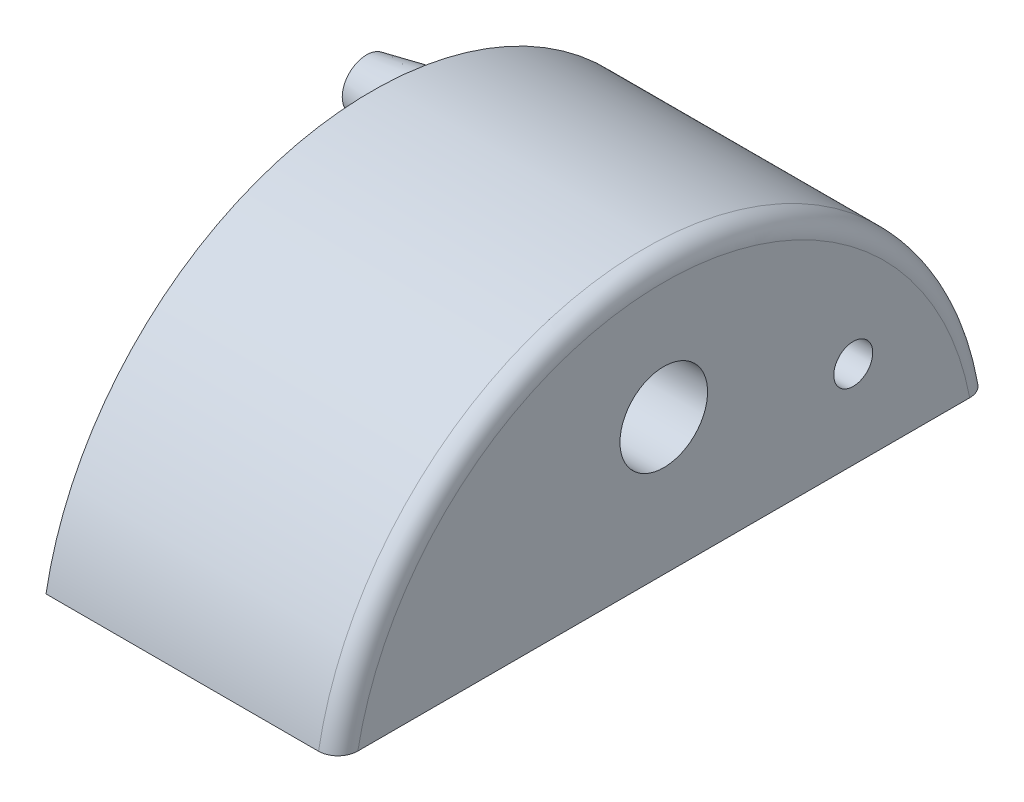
ISO-10303-21;
HEADER;
FILE_DESCRIPTION(('STEP AP214'),'2;1');
FILE_NAME('part.step','',(''),(''),'','','');
FILE_SCHEMA(('AUTOMOTIVE_DESIGN { 1 0 10303 214 1 1 1 1 }'));
ENDSEC;
DATA;
#1=APPLICATION_CONTEXT('core data for automotive mechanical design processes');
#2=APPLICATION_PROTOCOL_DEFINITION('international standard','automotive_design',2000,#1);
#3=PRODUCT_CONTEXT('',#1,'mechanical');
#4=PRODUCT('Part','Part','',(#3));
#5=PRODUCT_RELATED_PRODUCT_CATEGORY('part','',(#4));
#6=PRODUCT_DEFINITION_FORMATION('','',#4);
#7=PRODUCT_DEFINITION_CONTEXT('part definition',#1,'design');
#8=PRODUCT_DEFINITION('design','',#6,#7);
#9=PRODUCT_DEFINITION_SHAPE('','',#8);
#10=(LENGTH_UNIT() NAMED_UNIT(*) SI_UNIT(.MILLI.,.METRE.));
#11=(NAMED_UNIT(*) PLANE_ANGLE_UNIT() SI_UNIT($,.RADIAN.));
#12=(NAMED_UNIT(*) SI_UNIT($,.STERADIAN.) SOLID_ANGLE_UNIT());
#13=UNCERTAINTY_MEASURE_WITH_UNIT(LENGTH_MEASURE(1.E-05),#10,'distance_accuracy_value','');
#14=(GEOMETRIC_REPRESENTATION_CONTEXT(3) GLOBAL_UNCERTAINTY_ASSIGNED_CONTEXT((#13)) GLOBAL_UNIT_ASSIGNED_CONTEXT((#10,
#11,#12)) REPRESENTATION_CONTEXT('',''));
#15=CARTESIAN_POINT('',(0.,0.,0.));
#16=DIRECTION('',(0.,0.,1.));
#17=DIRECTION('',(1.,0.,0.));
#18=AXIS2_PLACEMENT_3D('',#15,#16,#17);
#19=CARTESIAN_POINT('',(15.,0.,0.));
#20=DIRECTION('',(-1.,0.,0.));
#21=DIRECTION('',(0.,0.,1.));
#22=AXIS2_PLACEMENT_3D('',#19,#20,#21);
#23=CYLINDRICAL_SURFACE('',#22,17.);
#24=DIRECTION('',(-1.,0.,0.));
#25=VECTOR('',#24,1.);
#26=CARTESIAN_POINT('',(15.,3.,16.7332005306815));
#27=LINE('',#26,#25);
#28=CARTESIAN_POINT('',(14.,3.,16.7332005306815));
#29=VERTEX_POINT('',#28);
#30=CARTESIAN_POINT('',(0.,3.,16.7332005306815));
#31=VERTEX_POINT('',#30);
#32=EDGE_CURVE('E73',#29,#31,#27,.T.);
#33=ORIENTED_EDGE('',*,*,#32,.F.);
#34=CARTESIAN_POINT('',(14.,0.,0.));
#35=DIRECTION('',(-1.,0.,0.));
#36=DIRECTION('',(0.,0.,1.));
#37=AXIS2_PLACEMENT_3D('',#34,#35,#36);
#38=CIRCLE('',#37,17.);
#39=CARTESIAN_POINT('',(14.,3.,-16.7332005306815));
#40=VERTEX_POINT('',#39);
#41=EDGE_CURVE('E62',#29,#40,#38,.T.);
#42=ORIENTED_EDGE('',*,*,#41,.T.);
#43=DIRECTION('',(-1.,0.,0.));
#44=VECTOR('',#43,1.);
#45=CARTESIAN_POINT('',(15.,3.,-16.7332005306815));
#46=LINE('',#45,#44);
#47=CARTESIAN_POINT('',(0.,3.,-16.7332005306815));
#48=VERTEX_POINT('',#47);
#49=EDGE_CURVE('E81',#40,#48,#46,.T.);
#50=ORIENTED_EDGE('',*,*,#49,.T.);
#51=CARTESIAN_POINT('',(0.,0.,0.));
#52=DIRECTION('',(1.,0.,0.));
#53=DIRECTION('',(0.,0.,1.));
#54=AXIS2_PLACEMENT_3D('',#51,#52,#53);
#55=CIRCLE('',#54,17.);
#56=EDGE_CURVE('E85',#48,#31,#55,.T.);
#57=ORIENTED_EDGE('',*,*,#56,.T.);
#58=EDGE_LOOP('',(#33,#42,#50,#57));
#59=FACE_BOUND('',#58,.T.);
#60=ADVANCED_FACE('F39',(#59),#23,.T.);
#61=CARTESIAN_POINT('',(15.,3.,16.7332005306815));
#62=DIRECTION('',(0.,1.,0.));
#63=DIRECTION('',(0.,0.,1.));
#64=AXIS2_PLACEMENT_3D('',#61,#62,#63);
#65=PLANE('',#64);
#66=DIRECTION('',(0.,0.,-1.));
#67=VECTOR('',#66,1.);
#68=CARTESIAN_POINT('',(15.,3.,16.7332005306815));
#69=LINE('',#68,#67);
#70=CARTESIAN_POINT('',(15.,3.,15.7162336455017));
#71=VERTEX_POINT('',#70);
#72=CARTESIAN_POINT('',(15.,3.,-15.7162336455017));
#73=VERTEX_POINT('',#72);
#74=EDGE_CURVE('E87',#71,#73,#69,.T.);
#75=ORIENTED_EDGE('',*,*,#74,.F.);
#76=CARTESIAN_POINT('',(15.,3.,15.7162336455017));
#77=CARTESIAN_POINT('',(15.0000448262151,3.,15.7741857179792));
#78=CARTESIAN_POINT('',(14.9951419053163,3.,15.832131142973));
#79=CARTESIAN_POINT('',(14.9757506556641,3.,15.9463826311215));
#80=CARTESIAN_POINT('',(14.9612645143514,3.,16.0026890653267));
#81=CARTESIAN_POINT('',(14.9230032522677,3.,16.1121027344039));
#82=CARTESIAN_POINT('',(14.899221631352,3.,16.1652077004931));
#83=CARTESIAN_POINT('',(14.8430105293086,3.,16.2666054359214));
#84=CARTESIAN_POINT('',(14.8105840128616,3.,16.3148998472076));
#85=CARTESIAN_POINT('',(14.7382831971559,3.,16.4048324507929));
#86=CARTESIAN_POINT('',(14.6984788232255,3.,16.4465268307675));
#87=CARTESIAN_POINT('',(14.6123218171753,3.,16.5225170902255));
#88=CARTESIAN_POINT('',(14.5659681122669,3.,16.5568117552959));
#89=CARTESIAN_POINT('',(14.4688365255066,3.,16.6164335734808));
#90=CARTESIAN_POINT('',(14.4181408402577,3.,16.6418948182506));
#91=CARTESIAN_POINT('',(14.3131672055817,3.,16.6837904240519));
#92=CARTESIAN_POINT('',(14.2588922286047,3.,16.7002321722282));
#93=CARTESIAN_POINT('',(14.1701703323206,3.,16.7189869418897));
#94=CARTESIAN_POINT('',(14.1363318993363,3.,16.7243140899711));
#95=CARTESIAN_POINT('',(14.0683342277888,3.,16.7314198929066));
#96=CARTESIAN_POINT('',(14.0341755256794,3.,16.733203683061));
#97=CARTESIAN_POINT('',(14.,3.,16.7332005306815));
#98=B_SPLINE_CURVE_WITH_KNOTS('',3,(#76,#77,#78,#79,#80,#81,#82,#83,#84,#85,#86,#87,#88,#89,#90,
#91,#92,#93,#94,#95,#96,#97),.UNSPECIFIED.,.F.,.F.,(4,2,2,2,2,2,2,2,2,2,4),(0.,
0.173640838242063,0.347242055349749,0.520964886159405,0.694628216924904,0.866722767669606,
1.0388455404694,1.20822766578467,1.37747085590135,1.48006684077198,1.58251402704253),.UNSPECIFIED.);
#99=EDGE_CURVE('E55',#71,#29,#98,.T.);
#100=ORIENTED_EDGE('',*,*,#99,.T.);
#101=ORIENTED_EDGE('',*,*,#32,.T.);
#102=DIRECTION('',(0.,0.,-1.));
#103=VECTOR('',#102,1.);
#104=CARTESIAN_POINT('',(0.,3.,16.7332005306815));
#105=LINE('',#104,#103);
#106=EDGE_CURVE('E76',#31,#48,#105,.T.);
#107=ORIENTED_EDGE('',*,*,#106,.T.);
#108=ORIENTED_EDGE('',*,*,#49,.F.);
#109=CARTESIAN_POINT('',(14.,3.,-16.7332005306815));
#110=CARTESIAN_POINT('',(14.0278086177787,3.,-16.7332005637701));
#111=CARTESIAN_POINT('',(14.0556038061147,3.,-16.7320212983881));
#112=CARTESIAN_POINT('',(14.1109929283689,3.,-16.727318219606));
#113=CARTESIAN_POINT('',(14.1385868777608,3.,-16.7237945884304));
#114=CARTESIAN_POINT('',(14.2206983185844,3.,-16.7097473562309));
#115=CARTESIAN_POINT('',(14.2746619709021,3.,-16.6957472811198));
#116=CARTESIAN_POINT('',(14.3794651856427,3.,-16.6588988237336));
#117=CARTESIAN_POINT('',(14.4303036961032,3.,-16.6360474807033));
#118=CARTESIAN_POINT('',(14.527459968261,3.,-16.5821892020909));
#119=CARTESIAN_POINT('',(14.5737779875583,3.,-16.5511827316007));
#120=CARTESIAN_POINT('',(14.6609239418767,3.,-16.4817033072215));
#121=CARTESIAN_POINT('',(14.7017136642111,3.,-16.4431824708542));
#122=CARTESIAN_POINT('',(14.7763699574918,3.,-16.3599224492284));
#123=CARTESIAN_POINT('',(14.8102350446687,3.,-16.3151819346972));
#124=CARTESIAN_POINT('',(14.8706209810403,3.,-16.2200438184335));
#125=CARTESIAN_POINT('',(14.8970230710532,3.,-16.1695709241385));
#126=CARTESIAN_POINT('',(14.9411181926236,3.,-16.0649621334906));
#127=CARTESIAN_POINT('',(14.9588141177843,3.,-16.0108274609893));
#128=CARTESIAN_POINT('',(14.9812689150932,3.,-15.9164280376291));
#129=CARTESIAN_POINT('',(14.98829001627,3.,-15.8766853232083));
#130=CARTESIAN_POINT('',(14.9976553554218,3.,-15.7967107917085));
#131=CARTESIAN_POINT('',(15.0000063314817,3.,-15.7564797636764));
#132=CARTESIAN_POINT('',(15.,3.,-15.7162336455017));
#133=B_SPLINE_CURVE_WITH_KNOTS('',3,(#109,#110,#111,#112,#113,#114,#115,#116,#117,#118,#119,
#120,#121,#122,#123,#124,#125,#126,#127,#128,#129,#130,#131,#132),.UNSPECIFIED.,.F.,.F.,(4,2,2,
2,2,2,2,2,2,2,2,4),(0.,0.0833742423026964,0.166742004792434,0.333132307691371,0.499578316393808,
0.666014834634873,0.833548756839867,1.00111853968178,1.17122142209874,1.3412677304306,
1.46208234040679,1.58272251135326),.UNSPECIFIED.);
#134=EDGE_CURVE('E104',#40,#73,#133,.T.);
#135=ORIENTED_EDGE('',*,*,#134,.T.);
#136=EDGE_LOOP('',(#75,#100,#101,#107,#108,#135));
#137=FACE_BOUND('',#136,.T.);
#138=ADVANCED_FACE('F75',(#137),#65,.F.);
#139=CARTESIAN_POINT('',(15.,0.,0.));
#140=DIRECTION('',(-1.,0.,0.));
#141=DIRECTION('',(0.,0.,1.));
#142=AXIS2_PLACEMENT_3D('',#139,#140,#141);
#143=PLANE('',#142);
#144=CARTESIAN_POINT('',(15.,7.5,-9.73320053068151));
#145=DIRECTION('',(-1.,0.,0.));
#146=DIRECTION('',(0.,0.,1.));
#147=AXIS2_PLACEMENT_3D('',#144,#145,#146);
#148=CIRCLE('',#147,1.);
#149=CARTESIAN_POINT('',(15.,7.5,-8.73320053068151));
#150=VERTEX_POINT('',#149);
#151=EDGE_CURVE('E209',#150,#150,#148,.T.);
#152=ORIENTED_EDGE('',*,*,#151,.T.);
#153=EDGE_LOOP('',(#152));
#154=FACE_BOUND('',#153,.T.);
#155=CARTESIAN_POINT('',(15.,10.,0.));
#156=DIRECTION('',(-1.,0.,0.));
#157=DIRECTION('',(0.,0.,1.));
#158=AXIS2_PLACEMENT_3D('',#155,#156,#157);
#159=CIRCLE('',#158,2.25);
#160=CARTESIAN_POINT('',(15.,10.,2.25));
#161=VERTEX_POINT('',#160);
#162=EDGE_CURVE('E90',#161,#161,#159,.T.);
#163=ORIENTED_EDGE('',*,*,#162,.T.);
#164=EDGE_LOOP('',(#163));
#165=FACE_BOUND('',#164,.T.);
#166=ORIENTED_EDGE('',*,*,#74,.T.);
#167=CARTESIAN_POINT('',(15.,0.,0.));
#168=DIRECTION('',(-1.,0.,0.));
#169=DIRECTION('',(0.,0.,1.));
#170=AXIS2_PLACEMENT_3D('',#167,#168,#169);
#171=CIRCLE('',#170,16.);
#172=EDGE_CURVE('E80',#73,#71,#171,.F.);
#173=ORIENTED_EDGE('',*,*,#172,.T.);
#174=EDGE_LOOP('',(#166,#173));
#175=FACE_BOUND('',#174,.T.);
#176=ADVANCED_FACE('F123',(#154,#165,#175),#143,.F.);
#177=CARTESIAN_POINT('',(0.,0.,0.));
#178=DIRECTION('',(-1.,0.,0.));
#179=DIRECTION('',(0.,0.,1.));
#180=AXIS2_PLACEMENT_3D('',#177,#178,#179);
#181=PLANE('',#180);
#182=CARTESIAN_POINT('',(0.,7.5,-9.73320053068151));
#183=DIRECTION('',(-1.,0.,0.));
#184=DIRECTION('',(0.,0.,1.));
#185=AXIS2_PLACEMENT_3D('',#182,#183,#184);
#186=CIRCLE('',#185,2.25);
#187=CARTESIAN_POINT('',(0.,7.5,-7.48320053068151));
#188=VERTEX_POINT('',#187);
#189=EDGE_CURVE('E215',#188,#188,#186,.T.);
#190=ORIENTED_EDGE('',*,*,#189,.F.);
#191=EDGE_LOOP('',(#190));
#192=FACE_BOUND('',#191,.T.);
#193=CARTESIAN_POINT('',(0.,10.,0.));
#194=DIRECTION('',(-1.,0.,0.));
#195=DIRECTION('',(0.,0.,1.));
#196=AXIS2_PLACEMENT_3D('',#193,#194,#195);
#197=CIRCLE('',#196,2.25);
#198=CARTESIAN_POINT('',(0.,10.,2.25));
#199=VERTEX_POINT('',#198);
#200=EDGE_CURVE('E94',#199,#199,#197,.T.);
#201=ORIENTED_EDGE('',*,*,#200,.F.);
#202=EDGE_LOOP('',(#201));
#203=FACE_BOUND('',#202,.T.);
#204=ORIENTED_EDGE('',*,*,#56,.F.);
#205=ORIENTED_EDGE('',*,*,#106,.F.);
#206=EDGE_LOOP('',(#204,#205));
#207=FACE_BOUND('',#206,.T.);
#208=ADVANCED_FACE('F84',(#192,#203,#207),#181,.T.);
#209=CARTESIAN_POINT('',(15.,10.,0.));
#210=DIRECTION('',(-1.,0.,0.));
#211=DIRECTION('',(0.,0.,1.));
#212=AXIS2_PLACEMENT_3D('',#209,#210,#211);
#213=CYLINDRICAL_SURFACE('',#212,2.25);
#214=ORIENTED_EDGE('',*,*,#162,.F.);
#215=EDGE_LOOP('',(#214));
#216=FACE_BOUND('',#215,.T.);
#217=ORIENTED_EDGE('',*,*,#200,.T.);
#218=EDGE_LOOP('',(#217));
#219=FACE_BOUND('',#218,.T.);
#220=ADVANCED_FACE('F133',(#216,#219),#213,.F.);
#221=CARTESIAN_POINT('',(14.,0.,0.));
#222=DIRECTION('',(-1.,0.,0.));
#223=DIRECTION('',(0.,0.,1.));
#224=AXIS2_PLACEMENT_3D('',#221,#222,#223);
#225=TOROIDAL_SURFACE('',#224,16.,1.);
#226=ORIENTED_EDGE('',*,*,#134,.F.);
#227=ORIENTED_EDGE('',*,*,#41,.F.);
#228=ORIENTED_EDGE('',*,*,#99,.F.);
#229=ORIENTED_EDGE('',*,*,#172,.F.);
#230=EDGE_LOOP('',(#226,#227,#228,#229));
#231=FACE_BOUND('',#230,.T.);
#232=ADVANCED_FACE('F117',(#231),#225,.T.);
#233=CARTESIAN_POINT('',(-10.,7.5,-9.73320053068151));
#234=DIRECTION('',(1.,0.,0.));
#235=DIRECTION('',(0.,0.,-1.));
#236=AXIS2_PLACEMENT_3D('',#233,#234,#235);
#237=CYLINDRICAL_SURFACE('',#236,2.25);
#238=CARTESIAN_POINT('',(-4.99999999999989,7.5,-9.73320053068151));
#239=DIRECTION('',(-1.,0.,0.));
#240=DIRECTION('',(0.,0.,1.));
#241=AXIS2_PLACEMENT_3D('',#238,#239,#240);
#242=CIRCLE('',#241,2.25);
#243=CARTESIAN_POINT('',(-4.99999999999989,7.5,-7.48320053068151));
#244=VERTEX_POINT('',#243);
#245=EDGE_CURVE('E11',#244,#244,#242,.F.);
#246=ORIENTED_EDGE('',*,*,#245,.T.);
#247=EDGE_LOOP('',(#246));
#248=FACE_BOUND('',#247,.T.);
#249=ORIENTED_EDGE('',*,*,#189,.T.);
#250=EDGE_LOOP('',(#249));
#251=FACE_BOUND('',#250,.T.);
#252=ADVANCED_FACE('F146',(#248,#251),#237,.T.);
#253=CARTESIAN_POINT('',(-10.,7.5,-9.73320053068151));
#254=DIRECTION('',(-1.,0.,0.));
#255=DIRECTION('',(0.,0.,1.));
#256=AXIS2_PLACEMENT_3D('',#253,#254,#255);
#257=PLANE('',#256);
#258=CARTESIAN_POINT('',(-10.,7.5,-9.73320053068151));
#259=DIRECTION('',(-1.,0.,0.));
#260=DIRECTION('',(0.,0.,1.));
#261=AXIS2_PLACEMENT_3D('',#258,#259,#260);
#262=CIRCLE('',#261,1.);
#263=CARTESIAN_POINT('',(-10.,7.5,-8.73320053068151));
#264=VERTEX_POINT('',#263);
#265=EDGE_CURVE('E212',#264,#264,#262,.T.);
#266=ORIENTED_EDGE('',*,*,#265,.F.);
#267=EDGE_LOOP('',(#266));
#268=FACE_BOUND('',#267,.T.);
#269=CARTESIAN_POINT('',(-10.,7.5,-9.73320053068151));
#270=DIRECTION('',(-1.,0.,0.));
#271=DIRECTION('',(0.,0.,1.));
#272=AXIS2_PLACEMENT_3D('',#269,#270,#271);
#273=CIRCLE('',#272,1.25);
#274=CARTESIAN_POINT('',(-10.,7.5,-8.48320053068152));
#275=VERTEX_POINT('',#274);
#276=EDGE_CURVE('E48',#275,#275,#273,.T.);
#277=ORIENTED_EDGE('',*,*,#276,.T.);
#278=EDGE_LOOP('',(#277));
#279=FACE_BOUND('',#278,.T.);
#280=ADVANCED_FACE('F161',(#268,#279),#257,.T.);
#281=CARTESIAN_POINT('',(-10.,7.5,-9.73320053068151));
#282=DIRECTION('',(1.,0.,0.));
#283=DIRECTION('',(0.,0.,-1.));
#284=AXIS2_PLACEMENT_3D('',#281,#282,#283);
#285=CONICAL_SURFACE('',#284,1.25,0.197395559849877);
#286=ORIENTED_EDGE('',*,*,#245,.F.);
#287=EDGE_LOOP('',(#286));
#288=FACE_BOUND('',#287,.T.);
#289=ORIENTED_EDGE('',*,*,#276,.F.);
#290=EDGE_LOOP('',(#289));
#291=FACE_BOUND('',#290,.T.);
#292=ADVANCED_FACE('F41',(#288,#291),#285,.T.);
#293=CARTESIAN_POINT('',(15.0588267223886,7.5,-9.73320053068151));
#294=DIRECTION('',(-1.,0.,0.));
#295=DIRECTION('',(0.,0.,1.));
#296=AXIS2_PLACEMENT_3D('',#293,#294,#295);
#297=CYLINDRICAL_SURFACE('',#296,1.);
#298=ORIENTED_EDGE('',*,*,#265,.T.);
#299=EDGE_LOOP('',(#298));
#300=FACE_BOUND('',#299,.T.);
#301=ORIENTED_EDGE('',*,*,#151,.F.);
#302=EDGE_LOOP('',(#301));
#303=FACE_BOUND('',#302,.T.);
#304=ADVANCED_FACE('F173',(#300,#303),#297,.F.);
#305=CLOSED_SHELL('',(#60,#138,#176,#208,#220,#232,#252,#280,#292,#304));
#306=MANIFOLD_SOLID_BREP('B2',#305);
#307=ADVANCED_BREP_SHAPE_REPRESENTATION('',(#18,#306),#14);
#308=SHAPE_DEFINITION_REPRESENTATION(#9,#307);
ENDSEC;
END-ISO-10303-21;
